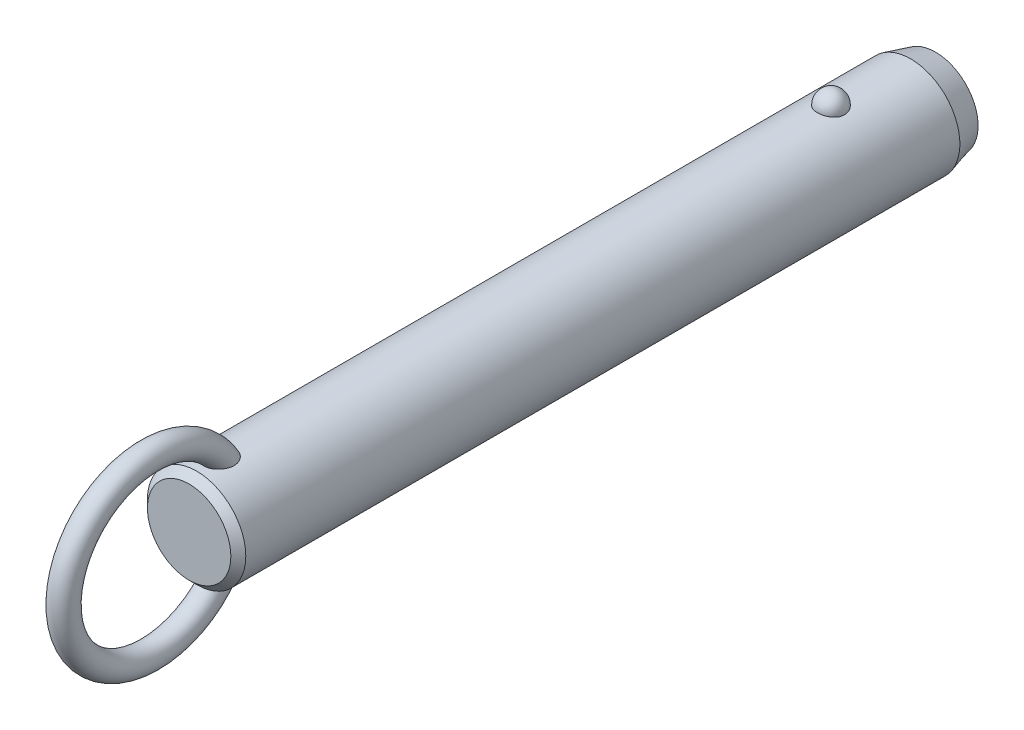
ISO-10303-21;
HEADER;
FILE_DESCRIPTION(('STEP AP214'),'2;1');
FILE_NAME('part.step','',(''),(''),'','','');
FILE_SCHEMA(('AUTOMOTIVE_DESIGN { 1 0 10303 214 1 1 1 1 }'));
ENDSEC;
DATA;
#1=APPLICATION_CONTEXT('core data for automotive mechanical design processes');
#2=APPLICATION_PROTOCOL_DEFINITION('international standard','automotive_design',2000,#1);
#3=PRODUCT_CONTEXT('',#1,'mechanical');
#4=PRODUCT('Part','Part','',(#3));
#5=PRODUCT_RELATED_PRODUCT_CATEGORY('part','',(#4));
#6=PRODUCT_DEFINITION_FORMATION('','',#4);
#7=PRODUCT_DEFINITION_CONTEXT('part definition',#1,'design');
#8=PRODUCT_DEFINITION('design','',#6,#7);
#9=PRODUCT_DEFINITION_SHAPE('','',#8);
#10=(LENGTH_UNIT() NAMED_UNIT(*) SI_UNIT(.MILLI.,.METRE.));
#11=(NAMED_UNIT(*) PLANE_ANGLE_UNIT() SI_UNIT($,.RADIAN.));
#12=(NAMED_UNIT(*) SI_UNIT($,.STERADIAN.) SOLID_ANGLE_UNIT());
#13=UNCERTAINTY_MEASURE_WITH_UNIT(LENGTH_MEASURE(1.E-05),#10,'distance_accuracy_value','');
#14=(GEOMETRIC_REPRESENTATION_CONTEXT(3) GLOBAL_UNCERTAINTY_ASSIGNED_CONTEXT((#13)) GLOBAL_UNIT_ASSIGNED_CONTEXT((#10,
#11,#12)) REPRESENTATION_CONTEXT('',''));
#15=CARTESIAN_POINT('',(0.,0.,0.));
#16=DIRECTION('',(0.,0.,1.));
#17=DIRECTION('',(1.,0.,0.));
#18=AXIS2_PLACEMENT_3D('',#15,#16,#17);
#19=CARTESIAN_POINT('',(0.,0.,91.4));
#20=DIRECTION('',(0.,0.,-1.));
#21=DIRECTION('',(-1.,0.,0.));
#22=AXIS2_PLACEMENT_3D('',#19,#20,#21);
#23=CYLINDRICAL_SURFACE('',#22,7.9);
#24=CARTESIAN_POINT('',(2.1785689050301,7.59367088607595,-2.19999999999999));
#25=CARTESIAN_POINT('',(2.17856679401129,7.59367269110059,-2.07701843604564));
#26=CARTESIAN_POINT('',(2.16853481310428,7.59657145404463,-1.95401006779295));
#27=CARTESIAN_POINT('',(2.12864689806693,7.607843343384,-1.71147811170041));
#28=CARTESIAN_POINT('',(2.09878338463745,7.61621856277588,-1.59195587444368));
#29=CARTESIAN_POINT('',(2.0199931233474,7.63749180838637,-1.3598563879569));
#30=CARTESIAN_POINT('',(1.97107475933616,7.65038784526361,-1.24727610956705));
#31=CARTESIAN_POINT('',(1.85539377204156,7.67926115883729,-1.03213234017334));
#32=CARTESIAN_POINT('',(1.78863158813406,7.69523835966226,-0.929568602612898));
#33=CARTESIAN_POINT('',(1.63856494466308,7.7285848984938,-0.736786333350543));
#34=CARTESIAN_POINT('',(1.55518140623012,7.7459606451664,-0.646630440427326));
#35=CARTESIAN_POINT('',(1.37422937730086,7.78009978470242,-0.481747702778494));
#36=CARTESIAN_POINT('',(1.27666086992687,7.7968631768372,-0.407020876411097));
#37=CARTESIAN_POINT('',(1.07024728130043,7.82786153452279,-0.275278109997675));
#38=CARTESIAN_POINT('',(0.961434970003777,7.84210353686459,-0.218212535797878));
#39=CARTESIAN_POINT('',(0.735351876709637,7.86652194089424,-0.123146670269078));
#40=CARTESIAN_POINT('',(0.618082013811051,7.87669878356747,-0.0851443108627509));
#41=CARTESIAN_POINT('',(0.380637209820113,7.89170521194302,-0.0298158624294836));
#42=CARTESIAN_POINT('',(0.260550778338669,7.89662650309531,-0.0121347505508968));
#43=CARTESIAN_POINT('',(0.0190117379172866,7.90090003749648,0.00324379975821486));
#44=CARTESIAN_POINT('',(-0.10244074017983,7.90025280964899,0.000943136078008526));
#45=CARTESIAN_POINT('',(-0.341452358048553,7.89351056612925,-0.0233955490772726));
#46=CARTESIAN_POINT('',(-0.45904225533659,7.88749257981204,-0.0451545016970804));
#47=CARTESIAN_POINT('',(-0.688796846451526,7.87075812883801,-0.107408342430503));
#48=CARTESIAN_POINT('',(-0.800961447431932,7.86004158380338,-0.147903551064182));
#49=CARTESIAN_POINT('',(-1.01743634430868,7.83497131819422,-0.246799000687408));
#50=CARTESIAN_POINT('',(-1.12169791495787,7.82059709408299,-0.305300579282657));
#51=CARTESIAN_POINT('',(-1.31891765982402,7.78976470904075,-0.438549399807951));
#52=CARTESIAN_POINT('',(-1.41187469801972,7.77330633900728,-0.513298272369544));
#53=CARTESIAN_POINT('',(-1.58577142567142,7.73972434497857,-0.678622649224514));
#54=CARTESIAN_POINT('',(-1.66645140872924,7.72259402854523,-0.769470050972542));
#55=CARTESIAN_POINT('',(-1.81161503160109,7.68983776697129,-0.963538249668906));
#56=CARTESIAN_POINT('',(-1.87609753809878,7.6742119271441,-1.06675991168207));
#57=CARTESIAN_POINT('',(-1.98790138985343,7.6460202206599,-1.28401170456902));
#58=CARTESIAN_POINT('',(-2.03501994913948,7.63349104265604,-1.39815107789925));
#59=CARTESIAN_POINT('',(-2.10986724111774,7.6131449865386,-1.63301784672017));
#60=CARTESIAN_POINT('',(-2.1375965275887,7.60532797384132,-1.75374505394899));
#61=CARTESIAN_POINT('',(-2.17289256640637,7.59531950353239,-1.99782562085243));
#62=CARTESIAN_POINT('',(-2.18054294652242,7.59310471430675,-2.12116592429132));
#63=CARTESIAN_POINT('',(-2.17572919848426,7.59448538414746,-2.36741799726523));
#64=CARTESIAN_POINT('',(-2.1632656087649,7.59808068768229,-2.49032977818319));
#65=CARTESIAN_POINT('',(-2.11865035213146,7.61064035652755,-2.73161015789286));
#66=CARTESIAN_POINT('',(-2.08659579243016,7.61957823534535,-2.84999812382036));
#67=CARTESIAN_POINT('',(-2.00367799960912,7.64179982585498,-3.07955956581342));
#68=CARTESIAN_POINT('',(-1.9528140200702,7.65508371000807,-3.19073275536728));
#69=CARTESIAN_POINT('',(-1.83321113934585,7.68460381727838,-3.40337899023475));
#70=CARTESIAN_POINT('',(-1.76437735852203,7.70085556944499,-3.50479651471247));
#71=CARTESIAN_POINT('',(-1.61069526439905,7.73445734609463,-3.69446912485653));
#72=CARTESIAN_POINT('',(-1.52584634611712,7.75180741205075,-3.78272371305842));
#73=CARTESIAN_POINT('',(-1.34198059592,7.78574608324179,-3.94393987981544));
#74=CARTESIAN_POINT('',(-1.24291308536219,7.80233167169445,-4.01684434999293));
#75=CARTESIAN_POINT('',(-1.03352039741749,7.83281625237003,-4.14489386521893));
#76=CARTESIAN_POINT('',(-0.923196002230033,7.84671543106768,-4.20004014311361));
#77=CARTESIAN_POINT('',(-0.695822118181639,7.87011575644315,-4.29042017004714));
#78=CARTESIAN_POINT('',(-0.578872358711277,7.87966903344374,-4.32589112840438));
#79=CARTESIAN_POINT('',(-0.340410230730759,7.8935652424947,-4.37692226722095));
#80=CARTESIAN_POINT('',(-0.218898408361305,7.89790879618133,-4.39248482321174));
#81=CARTESIAN_POINT('',(0.0228107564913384,7.90087453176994,-4.40314405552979));
#82=CARTESIAN_POINT('',(0.142990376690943,7.89960185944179,-4.39861683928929));
#83=CARTESIAN_POINT('',(0.380829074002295,7.89171262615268,-4.37008293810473));
#84=CARTESIAN_POINT('',(0.498488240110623,7.8850962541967,-4.34607694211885));
#85=CARTESIAN_POINT('',(0.727535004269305,7.86726442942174,-4.27939317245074));
#86=CARTESIAN_POINT('',(0.838944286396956,7.85606616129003,-4.236785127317));
#87=CARTESIAN_POINT('',(1.05295421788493,7.83025654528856,-4.13408348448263));
#88=CARTESIAN_POINT('',(1.15555431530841,7.81564498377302,-4.07398879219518));
#89=CARTESIAN_POINT('',(1.35076763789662,7.7843022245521,-3.93687432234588));
#90=CARTESIAN_POINT('',(1.4432046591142,7.76754209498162,-3.85961036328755));
#91=CARTESIAN_POINT('',(1.6139111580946,7.73387857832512,-3.69076949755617));
#92=CARTESIAN_POINT('',(1.6921781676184,7.71697516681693,-3.59919010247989));
#93=CARTESIAN_POINT('',(1.83380875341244,7.6845643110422,-3.40247278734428));
#94=CARTESIAN_POINT('',(1.89689280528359,7.66908588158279,-3.29712873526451));
#95=CARTESIAN_POINT('',(2.0047823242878,7.64159441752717,-3.07707931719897));
#96=CARTESIAN_POINT('',(2.0495945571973,7.62958010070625,-2.96237743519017));
#97=CARTESIAN_POINT('',(2.11580183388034,7.61146617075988,-2.74040519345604));
#98=CARTESIAN_POINT('',(2.13929812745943,7.60484503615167,-2.63379846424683));
#99=CARTESIAN_POINT('',(2.17068242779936,7.59594664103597,-2.41813481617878));
#100=CARTESIAN_POINT('',(2.17857077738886,7.59366928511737,-2.30907795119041));
#101=CARTESIAN_POINT('',(2.1785689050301,7.59367088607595,-2.19999999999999));
#102=B_SPLINE_CURVE_WITH_KNOTS('',3,(#24,#25,#26,#27,#28,#29,#30,#31,#32,#33,#34,#35,#36,#37,
#38,#39,#40,#41,#42,#43,#44,#45,#46,#47,#48,#49,#50,#51,#52,#53,#54,#55,#56,#57,#58,#59,#60,#61,
#62,#63,#64,#65,#66,#67,#68,#69,#70,#71,#72,#73,#74,#75,#76,#77,#78,#79,#80,#81,#82,#83,#84,#85,
#86,#87,#88,#89,#90,#91,#92,#93,#94,#95,#96,#97,#98,#99,#100,#101),.UNSPECIFIED.,.T.,.F.,(4,2,2,
2,2,2,2,2,2,2,2,2,2,2,2,2,2,2,2,2,2,2,2,2,2,2,2,2,2,2,2,2,2,2,2,2,2,2,4),(0.,0.368552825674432,
0.737246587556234,1.10577831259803,1.4743009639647,1.84462067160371,2.21494081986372,
2.58421058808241,2.95344028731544,3.31611630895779,3.67875788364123,4.03628044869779,
4.39380913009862,4.75338791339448,5.11300280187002,5.47939989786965,5.8458226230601,
6.21639834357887,6.58696347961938,6.95598276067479,7.32499216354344,7.69218715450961,
8.0593967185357,8.42858578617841,8.79778880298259,9.16834203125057,9.5388695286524,
9.90482699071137,10.2707407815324,10.6298333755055,10.9889132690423,11.3466585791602,
11.7044262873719,12.0676511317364,12.4309391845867,12.8004764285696,13.1698767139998,
13.4967701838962,13.8236564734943),.UNSPECIFIED.);
#103=CARTESIAN_POINT('',(2.1785689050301,7.59367088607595,-2.19999999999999));
#104=VERTEX_POINT('',#103);
#105=EDGE_CURVE('E41',#104,#104,#102,.T.);
#106=ORIENTED_EDGE('',*,*,#105,.T.);
#107=EDGE_LOOP('',(#106));
#108=FACE_BOUND('',#107,.T.);
#109=CARTESIAN_POINT('',(0.,0.,99.72));
#110=DIRECTION('',(0.,0.,1.));
#111=DIRECTION('',(1.,0.,0.));
#112=AXIS2_PLACEMENT_3D('',#109,#110,#111);
#113=CIRCLE('',#112,7.9);
#114=CARTESIAN_POINT('',(7.9,0.,99.72));
#115=VERTEX_POINT('',#114);
#116=EDGE_CURVE('E10',#115,#115,#113,.F.);
#117=ORIENTED_EDGE('',*,*,#116,.T.);
#118=EDGE_LOOP('',(#117));
#119=FACE_BOUND('',#118,.T.);
#120=CARTESIAN_POINT('',(-0.630969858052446,-7.87476203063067,93.6124322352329));
#121=CARTESIAN_POINT('',(-0.734180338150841,-7.8664899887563,93.647285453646));
#122=CARTESIAN_POINT('',(-0.834476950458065,-7.85639291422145,93.6908160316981));
#123=CARTESIAN_POINT('',(-1.02620356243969,-7.83366343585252,93.7940948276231));
#124=CARTESIAN_POINT('',(-1.1176141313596,-7.82102565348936,93.8538775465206));
#125=CARTESIAN_POINT('',(-1.28877277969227,-7.79464922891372,93.9878390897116));
#126=CARTESIAN_POINT('',(-1.36854014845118,-7.78091246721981,94.061993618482));
#127=CARTESIAN_POINT('',(-1.5146152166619,-7.75380398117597,94.2224941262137));
#128=CARTESIAN_POINT('',(-1.58092966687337,-7.74043207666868,94.3088339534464));
#129=CARTESIAN_POINT('',(-1.70019064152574,-7.71512522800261,94.4929784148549));
#130=CARTESIAN_POINT('',(-1.75284037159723,-7.70322473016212,94.5909792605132));
#131=CARTESIAN_POINT('',(-1.84263464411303,-7.68224112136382,94.7941029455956));
#132=CARTESIAN_POINT('',(-1.87977299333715,-7.6731591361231,94.8992286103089));
#133=CARTESIAN_POINT('',(-1.94152728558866,-7.65777930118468,95.1232849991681));
#134=CARTESIAN_POINT('',(-1.96475471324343,-7.65179654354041,95.2426167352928));
#135=CARTESIAN_POINT('',(-1.99449499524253,-7.64409642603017,95.4834298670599));
#136=CARTESIAN_POINT('',(-2.0010005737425,-7.64238092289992,95.6049121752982));
#137=CARTESIAN_POINT('',(-1.99856014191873,-7.64302120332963,95.8683409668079));
#138=CARTESIAN_POINT('',(-1.98680021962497,-7.64611845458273,96.0102565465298));
#139=CARTESIAN_POINT('',(-1.9445777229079,-7.65696186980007,96.2911188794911));
#140=CARTESIAN_POINT('',(-1.91409393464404,-7.66471330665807,96.4300620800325));
#141=CARTESIAN_POINT('',(-1.82768670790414,-7.68582947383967,96.731939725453));
#142=CARTESIAN_POINT('',(-1.76772963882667,-7.70003779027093,96.893686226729));
#143=CARTESIAN_POINT('',(-1.65998501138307,-7.72371550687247,97.1276956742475));
#144=CARTESIAN_POINT('',(-1.621079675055,-7.73200670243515,97.2042974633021));
#145=CARTESIAN_POINT('',(-1.53727726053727,-7.74910377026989,97.3540798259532));
#146=CARTESIAN_POINT('',(-1.49238215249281,-7.75790947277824,97.4272615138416));
#147=CARTESIAN_POINT('',(-1.3739705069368,-7.77993338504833,97.6028838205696));
#148=CARTESIAN_POINT('',(-1.29690364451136,-7.79328473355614,97.7029557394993));
#149=CARTESIAN_POINT('',(-1.1288548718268,-7.81939266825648,97.8907147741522));
#150=CARTESIAN_POINT('',(-1.03789926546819,-7.83215032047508,97.9784247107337));
#151=CARTESIAN_POINT('',(-0.869532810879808,-7.85231710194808,98.1134148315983));
#152=CARTESIAN_POINT('',(-0.795716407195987,-7.86021093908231,98.165076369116));
#153=CARTESIAN_POINT('',(-0.640813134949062,-7.87434920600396,98.2563815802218));
#154=CARTESIAN_POINT('',(-0.559737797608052,-7.88059619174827,98.2960438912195));
#155=CARTESIAN_POINT('',(-0.406456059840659,-7.88984116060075,98.3543008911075));
#156=CARTESIAN_POINT('',(-0.335227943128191,-7.89321892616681,98.3753848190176));
#157=CARTESIAN_POINT('',(-0.19019307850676,-7.89804235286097,98.4054141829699));
#158=CARTESIAN_POINT('',(-0.11638863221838,-7.89948969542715,98.4143701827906));
#159=CARTESIAN_POINT('',(0.0318414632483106,-7.90028409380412,98.4192915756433));
#160=CARTESIAN_POINT('',(0.106268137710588,-7.89962640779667,98.4152276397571));
#161=CARTESIAN_POINT('',(0.253290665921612,-7.8962818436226,98.3944615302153));
#162=CARTESIAN_POINT('',(0.325885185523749,-7.8935935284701,98.3777504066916));
#163=CARTESIAN_POINT('',(0.481441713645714,-7.88577340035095,98.3287380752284));
#164=CARTESIAN_POINT('',(0.563611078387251,-7.88026321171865,98.294005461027));
#165=CARTESIAN_POINT('',(0.721129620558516,-7.86741729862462,98.2117965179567));
#166=CARTESIAN_POINT('',(0.796466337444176,-7.86007832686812,98.1642975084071));
#167=CARTESIAN_POINT('',(0.971456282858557,-7.84073285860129,98.036513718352));
#168=CARTESIAN_POINT('',(1.0671968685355,-7.82809461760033,97.9510047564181));
#169=CARTESIAN_POINT('',(1.24418921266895,-7.80192439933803,97.766232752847));
#170=CARTESIAN_POINT('',(1.32540832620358,-7.78839049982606,97.6669395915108));
#171=CARTESIAN_POINT('',(1.45199971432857,-7.76559693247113,97.4895760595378));
#172=CARTESIAN_POINT('',(1.50085649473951,-7.75626094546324,97.4139542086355));
#173=CARTESIAN_POINT('',(1.59197749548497,-7.7380727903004,97.2587428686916));
#174=CARTESIAN_POINT('',(1.63423919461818,-7.72922080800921,97.1791518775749));
#175=CARTESIAN_POINT('',(1.71222612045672,-7.71231959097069,97.0166640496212));
#176=CARTESIAN_POINT('',(1.7479451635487,-7.70427111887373,96.933764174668));
#177=CARTESIAN_POINT('',(1.81270113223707,-7.68929240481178,96.7652967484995));
#178=CARTESIAN_POINT('',(1.84173789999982,-7.68236218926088,96.6797291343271));
#179=CARTESIAN_POINT('',(1.89322698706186,-7.6698375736,96.5052870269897));
#180=CARTESIAN_POINT('',(1.91558744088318,-7.66426199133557,96.4163838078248));
#181=CARTESIAN_POINT('',(1.95281367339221,-7.65485915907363,96.2369696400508));
#182=CARTESIAN_POINT('',(1.96767946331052,-7.65103190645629,96.1464586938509));
#183=CARTESIAN_POINT('',(2.00021456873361,-7.64262981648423,95.8737320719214));
#184=CARTESIAN_POINT('',(2.00600691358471,-7.6410871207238,95.6897099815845));
#185=CARTESIAN_POINT('',(1.98445334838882,-7.64669564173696,95.3765019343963));
#186=CARTESIAN_POINT('',(1.96607186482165,-7.65149688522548,95.246618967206));
#187=CARTESIAN_POINT('',(1.90884967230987,-7.6659762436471,94.9916321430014));
#188=CARTESIAN_POINT('',(1.87002101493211,-7.67565148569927,94.866525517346));
#189=CARTESIAN_POINT('',(1.77063986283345,-7.69918471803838,94.6245401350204));
#190=CARTESIAN_POINT('',(1.7099372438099,-7.71307150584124,94.5077250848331));
#191=CARTESIAN_POINT('',(1.56733070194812,-7.74330306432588,94.2881444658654));
#192=CARTESIAN_POINT('',(1.48543692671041,-7.75964665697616,94.1853722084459));
#193=CARTESIAN_POINT('',(1.31346177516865,-7.79047523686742,94.0093800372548));
#194=CARTESIAN_POINT('',(1.22547278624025,-7.80495298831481,93.9341066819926));
#195=CARTESIAN_POINT('',(1.03724352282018,-7.83218597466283,93.8004864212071));
#196=CARTESIAN_POINT('',(0.937008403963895,-7.84494192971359,93.7421324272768));
#197=CARTESIAN_POINT('',(0.733599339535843,-7.86649045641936,93.6470270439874));
#198=CARTESIAN_POINT('',(0.630941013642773,-7.87547134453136,93.6092109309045));
#199=CARTESIAN_POINT('',(0.420465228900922,-7.88950708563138,93.5511160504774));
#200=CARTESIAN_POINT('',(0.312645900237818,-7.89456050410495,93.5308436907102));
#201=CARTESIAN_POINT('',(0.0960869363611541,-7.9001518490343,93.5084559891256));
#202=CARTESIAN_POINT('',(-0.0126341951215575,-7.90073226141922,93.5061698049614));
#203=CARTESIAN_POINT('',(-0.228766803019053,-7.89742350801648,93.5193678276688));
#204=CARTESIAN_POINT('',(-0.336180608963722,-7.89354403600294,93.5348134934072));
#205=CARTESIAN_POINT('',(-0.473410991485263,-7.88586871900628,93.5662177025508));
#206=CARTESIAN_POINT('',(-0.5052577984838,-7.88388984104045,93.5743541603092));
#207=CARTESIAN_POINT('',(-0.568481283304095,-7.87958326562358,93.5922083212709));
#208=CARTESIAN_POINT('',(-0.599857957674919,-7.87725556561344,93.6019260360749));
#209=CARTESIAN_POINT('',(-0.630969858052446,-7.87476203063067,93.6124322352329));
#210=B_SPLINE_CURVE_WITH_KNOTS('',3,(#120,#121,#122,#123,#124,#125,#126,#127,#128,#129,#130,
#131,#132,#133,#134,#135,#136,#137,#138,#139,#140,#141,#142,#143,#144,#145,#146,#147,#148,#149,
#150,#151,#152,#153,#154,#155,#156,#157,#158,#159,#160,#161,#162,#163,#164,#165,#166,#167,#168,
#169,#170,#171,#172,#173,#174,#175,#176,#177,#178,#179,#180,#181,#182,#183,#184,#185,#186,#187,
#188,#189,#190,#191,#192,#193,#194,#195,#196,#197,#198,#199,#200,#201,#202,#203,#204,#205,#206,
#207,#208,#209),.UNSPECIFIED.,.T.,.F.,(4,2,2,2,2,2,2,2,2,2,2,2,2,2,2,2,2,2,2,2,2,2,2,2,2,2,2,2,
2,2,2,2,2,2,2,2,2,2,2,2,2,2,2,2,4),(0.,0.327622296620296,0.655945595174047,0.983718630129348,
1.3113267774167,1.64554655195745,1.97989964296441,2.3436572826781,2.70757317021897,
3.13333684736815,3.55958380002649,4.07655306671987,4.3352789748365,4.59391999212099,
4.97382437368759,5.35301797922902,5.62348245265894,5.89352465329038,6.11565959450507,
6.3376009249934,6.56004255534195,6.78264174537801,7.04930844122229,7.31645206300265,
7.70130871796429,8.08701995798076,8.35824509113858,8.62957365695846,8.90115735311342,
9.17274746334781,9.44791855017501,9.7230892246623,10.2715298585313,10.6638393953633,
11.0559179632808,11.4507403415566,11.845374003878,12.1936425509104,12.5417649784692,
12.8695063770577,13.1973674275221,13.5221104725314,13.8461490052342,13.9449071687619,
14.0436660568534),.UNSPECIFIED.);
#211=CARTESIAN_POINT('',(-0.630969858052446,-7.87476203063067,93.6124322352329));
#212=VERTEX_POINT('',#211);
#213=EDGE_CURVE('E59',#212,#212,#210,.T.);
#214=ORIENTED_EDGE('',*,*,#213,.T.);
#215=EDGE_LOOP('',(#214));
#216=FACE_BOUND('',#215,.T.);
#217=CARTESIAN_POINT('',(-0.630969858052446,7.87476203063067,93.6124322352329));
#218=CARTESIAN_POINT('',(-0.528918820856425,7.88293636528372,93.5779798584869));
#219=CARTESIAN_POINT('',(-0.423745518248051,7.8893481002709,93.551915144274));
#220=CARTESIAN_POINT('',(-0.210236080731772,7.8979273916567,93.5172825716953));
#221=CARTESIAN_POINT('',(-0.10189380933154,7.90008607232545,93.5087513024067));
#222=CARTESIAN_POINT('',(0.114660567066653,7.89990877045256,93.5094570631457));
#223=CARTESIAN_POINT('',(0.222872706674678,7.89757640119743,93.5186798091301));
#224=CARTESIAN_POINT('',(0.436107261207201,7.88867538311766,93.5546525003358));
#225=CARTESIAN_POINT('',(0.541131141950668,7.8821087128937,93.5813942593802));
#226=CARTESIAN_POINT('',(0.745085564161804,7.86545130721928,93.6517561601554));
#227=CARTESIAN_POINT('',(0.844015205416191,7.85536005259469,93.6953787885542));
#228=CARTESIAN_POINT('',(1.03299167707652,7.83275153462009,93.7983796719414));
#229=CARTESIAN_POINT('',(1.12303841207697,7.8202342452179,93.8577580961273));
#230=CARTESIAN_POINT('',(1.29214734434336,7.79408219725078,93.9908647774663));
#231=CARTESIAN_POINT('',(1.37116907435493,7.78044359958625,94.0646436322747));
#232=CARTESIAN_POINT('',(1.51597677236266,7.75353170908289,94.2242353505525));
#233=CARTESIAN_POINT('',(1.58176261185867,7.74025841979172,94.3100483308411));
#234=CARTESIAN_POINT('',(1.70057386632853,7.71504069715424,94.493644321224));
#235=CARTESIAN_POINT('',(1.75320073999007,7.7031425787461,94.5916906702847));
#236=CARTESIAN_POINT('',(1.84293767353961,7.68216822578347,94.7948931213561));
#237=CARTESIAN_POINT('',(1.88004278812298,7.67309289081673,94.9000514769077));
#238=CARTESIAN_POINT('',(1.9417232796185,7.6577294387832,95.1241671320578));
#239=CARTESIAN_POINT('',(1.96491037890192,7.65175648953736,95.2435248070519));
#240=CARTESIAN_POINT('',(1.9945689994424,7.64407702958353,95.4843848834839));
#241=CARTESIAN_POINT('',(2.00103304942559,7.64237242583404,95.6058882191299));
#242=CARTESIAN_POINT('',(1.9985016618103,7.64303650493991,95.8693688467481));
#243=CARTESIAN_POINT('',(1.98669038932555,7.64614714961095,96.0113141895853));
#244=CARTESIAN_POINT('',(1.94436120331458,7.6570170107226,96.2922287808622));
#245=CARTESIAN_POINT('',(1.91382203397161,7.66478150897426,96.4311944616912));
#246=CARTESIAN_POINT('',(1.82728754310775,7.68592483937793,96.7331110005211));
#247=CARTESIAN_POINT('',(1.76725778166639,7.70014685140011,96.894872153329));
#248=CARTESIAN_POINT('',(1.65939700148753,7.72384204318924,97.1288914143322));
#249=CARTESIAN_POINT('',(1.62045187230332,7.73213852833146,97.2054942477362));
#250=CARTESIAN_POINT('',(1.53656684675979,7.74924489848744,97.3552737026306));
#251=CARTESIAN_POINT('',(1.49162892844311,7.75805461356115,97.4284514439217));
#252=CARTESIAN_POINT('',(1.37317698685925,7.78007342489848,97.6039520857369));
#253=CARTESIAN_POINT('',(1.29612360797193,7.79341423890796,97.7039112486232));
#254=CARTESIAN_POINT('',(1.12812043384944,7.81949839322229,97.8914508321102));
#255=CARTESIAN_POINT('',(1.03719688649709,7.83224280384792,97.9790540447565));
#256=CARTESIAN_POINT('',(0.868871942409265,7.85239026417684,98.1138971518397));
#257=CARTESIAN_POINT('',(0.795056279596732,7.86027769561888,98.1655113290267));
#258=CARTESIAN_POINT('',(0.640160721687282,7.87440222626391,98.2567201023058));
#259=CARTESIAN_POINT('',(0.559092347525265,7.88064188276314,98.2963333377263));
#260=CARTESIAN_POINT('',(0.405820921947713,7.8898738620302,98.3545056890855));
#261=CARTESIAN_POINT('',(0.334594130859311,7.89324577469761,98.3755523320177));
#262=CARTESIAN_POINT('',(0.189568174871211,7.89805733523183,98.4055070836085));
#263=CARTESIAN_POINT('',(0.115771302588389,7.89949866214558,98.4144257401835));
#264=CARTESIAN_POINT('',(-0.032435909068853,7.90028156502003,98.4192758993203));
#265=CARTESIAN_POINT('',(-0.106847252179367,7.89961843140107,98.4151782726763));
#266=CARTESIAN_POINT('',(-0.253834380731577,7.8962642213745,98.3943519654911));
#267=CARTESIAN_POINT('',(-0.326408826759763,7.89357170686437,98.3776143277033));
#268=CARTESIAN_POINT('',(-0.481962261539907,7.88574179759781,98.3285391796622));
#269=CARTESIAN_POINT('',(-0.564145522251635,7.88022507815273,98.2937638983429));
#270=CARTESIAN_POINT('',(-0.72168526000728,7.8673664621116,98.2114686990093));
#271=CARTESIAN_POINT('',(-0.797029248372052,7.8600213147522,98.1639260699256));
#272=CARTESIAN_POINT('',(-0.972044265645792,7.84066026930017,98.0360267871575));
#273=CARTESIAN_POINT('',(-1.06779803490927,7.82801274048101,97.9504436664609));
#274=CARTESIAN_POINT('',(-1.24480531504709,7.80182621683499,97.7655223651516));
#275=CARTESIAN_POINT('',(-1.3260261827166,7.78828530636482,97.6661540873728));
#276=CARTESIAN_POINT('',(-1.45259834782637,7.76548487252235,97.4886806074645));
#277=CARTESIAN_POINT('',(-1.50143856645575,7.75614818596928,97.4130252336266));
#278=CARTESIAN_POINT('',(-1.59252410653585,7.73796020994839,97.2577484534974));
#279=CARTESIAN_POINT('',(-1.63476690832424,7.72910910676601,97.1781255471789));
#280=CARTESIAN_POINT('',(-1.71271318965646,7.71221133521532,97.0155750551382));
#281=CARTESIAN_POINT('',(-1.74841047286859,7.70416543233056,96.9326444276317));
#282=CARTESIAN_POINT('',(-1.81311929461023,7.68919371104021,96.7641168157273));
#283=CARTESIAN_POINT('',(-1.84213067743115,7.6822679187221,96.6785197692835));
#284=CARTESIAN_POINT('',(-1.89356259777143,7.66975461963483,96.5040254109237));
#285=CARTESIAN_POINT('',(-1.91589165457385,7.66418586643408,96.4150995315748));
#286=CARTESIAN_POINT('',(-1.95305070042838,7.65479859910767,96.2356424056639));
#287=CARTESIAN_POINT('',(-1.96788069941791,7.65098008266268,96.1451111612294));
#288=CARTESIAN_POINT('',(-2.00030078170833,7.64260704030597,95.8723270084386));
#289=CARTESIAN_POINT('',(-2.00600576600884,7.64108760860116,95.6882718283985));
#290=CARTESIAN_POINT('',(-1.98428483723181,7.64673945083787,95.3750800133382));
#291=CARTESIAN_POINT('',(-1.96583698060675,7.6515575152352,95.2452400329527));
#292=CARTESIAN_POINT('',(-1.90848948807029,7.66606613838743,94.9903619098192));
#293=CARTESIAN_POINT('',(-1.86960376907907,7.67575338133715,94.865320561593));
#294=CARTESIAN_POINT('',(-1.7701342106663,7.69930132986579,94.6235009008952));
#295=CARTESIAN_POINT('',(-1.70940488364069,7.71318991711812,94.5067844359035));
#296=CARTESIAN_POINT('',(-1.56672953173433,7.74342495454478,94.2873404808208));
#297=CARTESIAN_POINT('',(-1.48478316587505,7.75977144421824,94.1846132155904));
#298=CARTESIAN_POINT('',(-1.31266325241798,7.79061163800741,94.0086431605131));
#299=CARTESIAN_POINT('',(-1.22456383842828,7.80509908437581,93.9333589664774));
#300=CARTESIAN_POINT('',(-1.03622400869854,7.83231881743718,93.7998659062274));
#301=CARTESIAN_POINT('',(-0.93601531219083,7.84505551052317,93.7416137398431));
#302=CARTESIAN_POINT('',(-0.798824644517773,7.85957802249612,93.6775408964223));
#303=CARTESIAN_POINT('',(-0.765787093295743,7.86286821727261,93.6632248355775));
#304=CARTESIAN_POINT('',(-0.698939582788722,7.86909211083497,93.636436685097));
#305=CARTESIAN_POINT('',(-0.66512963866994,7.8720258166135,93.6239645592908));
#306=CARTESIAN_POINT('',(-0.630969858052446,7.87476203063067,93.6124322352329));
#307=B_SPLINE_CURVE_WITH_KNOTS('',3,(#217,#218,#219,#220,#221,#222,#223,#224,#225,#226,#227,
#228,#229,#230,#231,#232,#233,#234,#235,#236,#237,#238,#239,#240,#241,#242,#243,#244,#245,#246,
#247,#248,#249,#250,#251,#252,#253,#254,#255,#256,#257,#258,#259,#260,#261,#262,#263,#264,#265,
#266,#267,#268,#269,#270,#271,#272,#273,#274,#275,#276,#277,#278,#279,#280,#281,#282,#283,#284,
#285,#286,#287,#288,#289,#290,#291,#292,#293,#294,#295,#296,#297,#298,#299,#300,#301,#302,#303,
#304,#305,#306),.UNSPECIFIED.,.T.,.F.,(4,2,2,2,2,2,2,2,2,2,2,2,2,2,2,2,2,2,2,2,2,2,2,2,2,2,2,2,
2,2,2,2,2,2,2,2,2,2,2,2,2,2,2,2,4),(0.,0.323920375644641,0.648516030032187,0.97285063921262,
1.29703380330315,1.62126473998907,1.94549915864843,2.27089401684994,2.5962920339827,
2.93059633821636,3.26500707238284,3.62881644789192,3.99278833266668,4.41865421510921,
4.84500434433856,5.36209210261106,5.62087589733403,5.87957448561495,6.25918598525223,
6.63808782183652,6.90846748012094,7.17842501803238,7.40052350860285,7.62242871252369,
7.84483086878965,8.06739077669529,8.33414615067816,8.60137921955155,8.98641454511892,
9.37230415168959,9.64358673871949,9.91497268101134,10.1866142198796,10.4582620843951,
10.7334745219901,11.0086865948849,11.5572126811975,11.9494246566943,12.3413699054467,
12.7359755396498,13.1305875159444,13.4791770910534,13.82687259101,13.9353013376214,
14.0437279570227),.UNSPECIFIED.);
#308=CARTESIAN_POINT('',(-0.630969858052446,7.87476203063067,93.6124322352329));
#309=VERTEX_POINT('',#308);
#310=EDGE_CURVE('E67',#309,#309,#307,.T.);
#311=ORIENTED_EDGE('',*,*,#310,.T.);
#312=EDGE_LOOP('',(#311));
#313=FACE_BOUND('',#312,.T.);
#314=CARTESIAN_POINT('',(0.,0.,-15.0000000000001));
#315=DIRECTION('',(0.,0.,-1.));
#316=DIRECTION('',(-1.,0.,0.));
#317=AXIS2_PLACEMENT_3D('',#314,#315,#316);
#318=CIRCLE('',#317,7.9);
#319=CARTESIAN_POINT('',(-7.9,0.,-15.0000000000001));
#320=VERTEX_POINT('',#319);
#321=EDGE_CURVE('E56',#320,#320,#318,.F.);
#322=ORIENTED_EDGE('',*,*,#321,.T.);
#323=EDGE_LOOP('',(#322));
#324=FACE_BOUND('',#323,.T.);
#325=ADVANCED_FACE('F37',(#108,#119,#216,#313,#324),#23,.T.);
#326=CARTESIAN_POINT('',(0.,0.,-19.));
#327=DIRECTION('',(0.,0.,-1.));
#328=DIRECTION('',(-1.,0.,0.));
#329=AXIS2_PLACEMENT_3D('',#326,#327,#328);
#330=PLANE('',#329);
#331=CARTESIAN_POINT('',(0.,0.,-19.));
#332=DIRECTION('',(0.,0.,-1.));
#333=DIRECTION('',(-1.,0.,0.));
#334=AXIS2_PLACEMENT_3D('',#331,#332,#333);
#335=CIRCLE('',#334,6.82820323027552);
#336=CARTESIAN_POINT('',(-6.82820323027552,0.,-19.));
#337=VERTEX_POINT('',#336);
#338=EDGE_CURVE('E66',#337,#337,#335,.T.);
#339=ORIENTED_EDGE('',*,*,#338,.T.);
#340=EDGE_LOOP('',(#339));
#341=FACE_BOUND('',#340,.T.);
#342=ADVANCED_FACE('F85',(#341),#330,.T.);
#343=CARTESIAN_POINT('',(0.,0.,-19.));
#344=DIRECTION('',(0.,0.,1.));
#345=DIRECTION('',(1.,0.,0.));
#346=AXIS2_PLACEMENT_3D('',#343,#344,#345);
#347=CONICAL_SURFACE('',#346,6.82820323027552,0.261799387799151);
#348=ORIENTED_EDGE('',*,*,#321,.F.);
#349=EDGE_LOOP('',(#348));
#350=FACE_BOUND('',#349,.T.);
#351=ORIENTED_EDGE('',*,*,#338,.F.);
#352=EDGE_LOOP('',(#351));
#353=FACE_BOUND('',#352,.T.);
#354=ADVANCED_FACE('F83',(#350,#353),#347,.T.);
#355=CARTESIAN_POINT('',(0.,0.,100.92));
#356=DIRECTION('',(0.,0.,1.));
#357=DIRECTION('',(1.,0.,0.));
#358=AXIS2_PLACEMENT_3D('',#355,#356,#357);
#359=PLANE('',#358);
#360=CARTESIAN_POINT('',(0.,0.,100.92));
#361=DIRECTION('',(0.,0.,1.));
#362=DIRECTION('',(1.,0.,0.));
#363=AXIS2_PLACEMENT_3D('',#360,#361,#362);
#364=CIRCLE('',#363,6.70000000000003);
#365=CARTESIAN_POINT('',(6.70000000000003,0.,100.92));
#366=VERTEX_POINT('',#365);
#367=EDGE_CURVE('E50',#366,#366,#364,.T.);
#368=ORIENTED_EDGE('',*,*,#367,.T.);
#369=EDGE_LOOP('',(#368));
#370=FACE_BOUND('',#369,.T.);
#371=ADVANCED_FACE('F77',(#370),#359,.T.);
#372=CARTESIAN_POINT('',(0.,0.,107.25));
#373=DIRECTION('',(1.,0.,0.));
#374=DIRECTION('',(0.,0.,-1.));
#375=AXIS2_PLACEMENT_3D('',#372,#373,#374);
#376=TOROIDAL_SURFACE('',#375,13.85,2.);
#377=ORIENTED_EDGE('',*,*,#310,.F.);
#378=EDGE_LOOP('',(#377));
#379=FACE_BOUND('',#378,.T.);
#380=ORIENTED_EDGE('',*,*,#213,.F.);
#381=EDGE_LOOP('',(#380));
#382=FACE_BOUND('',#381,.T.);
#383=ADVANCED_FACE('F73',(#379,#382),#376,.T.);
#384=CARTESIAN_POINT('',(0.,0.,100.92));
#385=DIRECTION('',(0.,0.,-1.));
#386=DIRECTION('',(-1.,0.,0.));
#387=AXIS2_PLACEMENT_3D('',#384,#385,#386);
#388=CONICAL_SURFACE('',#387,6.70000000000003,0.785398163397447);
#389=ORIENTED_EDGE('',*,*,#116,.F.);
#390=EDGE_LOOP('',(#389));
#391=FACE_BOUND('',#390,.T.);
#392=ORIENTED_EDGE('',*,*,#367,.F.);
#393=EDGE_LOOP('',(#392));
#394=FACE_BOUND('',#393,.T.);
#395=ADVANCED_FACE('F39',(#391,#394),#388,.T.);
#396=CARTESIAN_POINT('',(0.,7.9,-2.19999999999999));
#397=DIRECTION('',(0.,1.,0.));
#398=DIRECTION('',(0.,0.,-1.));
#399=AXIS2_PLACEMENT_3D('',#396,#397,#398);
#400=SPHERICAL_SURFACE('',#399,2.2);
#401=ORIENTED_EDGE('',*,*,#105,.F.);
#402=EDGE_LOOP('',(#401));
#403=FACE_BOUND('',#402,.T.);
#404=ADVANCED_FACE('F79',(#403),#400,.T.);
#405=CLOSED_SHELL('',(#325,#342,#354,#371,#383,#395,#404));
#406=MANIFOLD_SOLID_BREP('B2',#405);
#407=ADVANCED_BREP_SHAPE_REPRESENTATION('',(#18,#406),#14);
#408=SHAPE_DEFINITION_REPRESENTATION(#9,#407);
ENDSEC;
END-ISO-10303-21;
